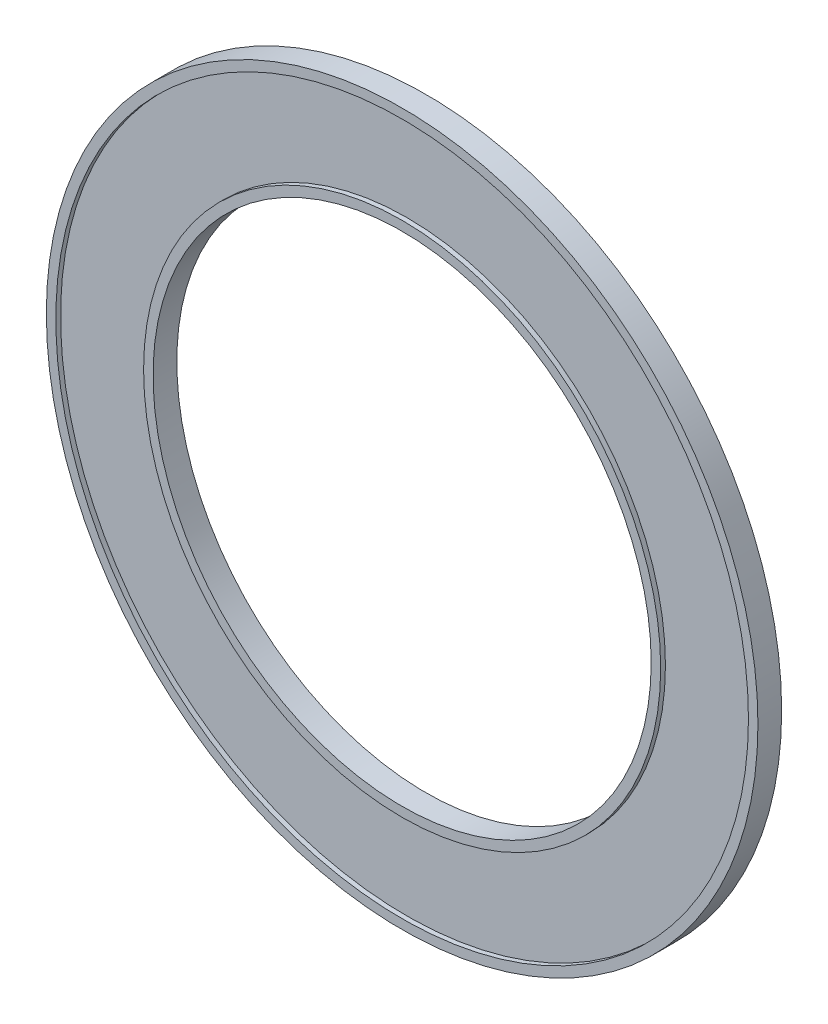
ISO-10303-21;
HEADER;
FILE_DESCRIPTION(('STEP AP214'),'2;1');
FILE_NAME('part.step','',(''),(''),'','','');
FILE_SCHEMA(('AUTOMOTIVE_DESIGN { 1 0 10303 214 1 1 1 1 }'));
ENDSEC;
DATA;
#1=APPLICATION_CONTEXT('core data for automotive mechanical design processes');
#2=APPLICATION_PROTOCOL_DEFINITION('international standard','automotive_design',2000,#1);
#3=PRODUCT_CONTEXT('',#1,'mechanical');
#4=PRODUCT('Part','Part','',(#3));
#5=PRODUCT_RELATED_PRODUCT_CATEGORY('part','',(#4));
#6=PRODUCT_DEFINITION_FORMATION('','',#4);
#7=PRODUCT_DEFINITION_CONTEXT('part definition',#1,'design');
#8=PRODUCT_DEFINITION('design','',#6,#7);
#9=PRODUCT_DEFINITION_SHAPE('','',#8);
#10=(LENGTH_UNIT() NAMED_UNIT(*) SI_UNIT(.MILLI.,.METRE.));
#11=(NAMED_UNIT(*) PLANE_ANGLE_UNIT() SI_UNIT($,.RADIAN.));
#12=(NAMED_UNIT(*) SI_UNIT($,.STERADIAN.) SOLID_ANGLE_UNIT());
#13=UNCERTAINTY_MEASURE_WITH_UNIT(LENGTH_MEASURE(1.E-05),#10,'distance_accuracy_value','');
#14=(GEOMETRIC_REPRESENTATION_CONTEXT(3) GLOBAL_UNCERTAINTY_ASSIGNED_CONTEXT((#13)) GLOBAL_UNIT_ASSIGNED_CONTEXT((#10,
#11,#12)) REPRESENTATION_CONTEXT('',''));
#15=CARTESIAN_POINT('',(0.,0.,0.));
#16=DIRECTION('',(0.,0.,1.));
#17=DIRECTION('',(1.,0.,0.));
#18=AXIS2_PLACEMENT_3D('',#15,#16,#17);
#19=CARTESIAN_POINT('',(0.,0.,10.));
#20=DIRECTION('',(0.,0.,1.));
#21=DIRECTION('',(1.,0.,0.));
#22=AXIS2_PLACEMENT_3D('',#19,#20,#21);
#23=PLANE('',#22);
#24=CARTESIAN_POINT('',(0.,0.,10.));
#25=DIRECTION('',(0.,0.,1.));
#26=DIRECTION('',(1.,0.,0.));
#27=AXIS2_PLACEMENT_3D('',#24,#25,#26);
#28=CIRCLE('',#27,105.);
#29=CARTESIAN_POINT('',(105.,0.,10.));
#30=VERTEX_POINT('',#29);
#31=EDGE_CURVE('E42',#30,#30,#28,.T.);
#32=ORIENTED_EDGE('',*,*,#31,.F.);
#33=EDGE_LOOP('',(#32));
#34=FACE_BOUND('',#33,.T.);
#35=CARTESIAN_POINT('',(0.,0.,10.));
#36=DIRECTION('',(0.,0.,1.));
#37=DIRECTION('',(1.,0.,0.));
#38=AXIS2_PLACEMENT_3D('',#35,#36,#37);
#39=CIRCLE('',#38,109.);
#40=CARTESIAN_POINT('',(109.,0.,10.));
#41=VERTEX_POINT('',#40);
#42=EDGE_CURVE('E54',#41,#41,#39,.T.);
#43=ORIENTED_EDGE('',*,*,#42,.T.);
#44=EDGE_LOOP('',(#43));
#45=FACE_BOUND('',#44,.T.);
#46=ADVANCED_FACE('F31',(#34,#45),#23,.T.);
#47=CARTESIAN_POINT('',(0.,0.,10.));
#48=DIRECTION('',(0.,0.,1.));
#49=DIRECTION('',(1.,0.,0.));
#50=AXIS2_PLACEMENT_3D('',#47,#48,#49);
#51=CIRCLE('',#50,146.);
#52=CARTESIAN_POINT('',(146.,0.,10.));
#53=VERTEX_POINT('',#52);
#54=EDGE_CURVE('E50',#53,#53,#51,.T.);
#55=ORIENTED_EDGE('',*,*,#54,.F.);
#56=EDGE_LOOP('',(#55));
#57=FACE_BOUND('',#56,.T.);
#58=CARTESIAN_POINT('',(0.,0.,10.));
#59=DIRECTION('',(0.,0.,1.));
#60=DIRECTION('',(1.,0.,0.));
#61=AXIS2_PLACEMENT_3D('',#58,#59,#60);
#62=CIRCLE('',#61,150.);
#63=CARTESIAN_POINT('',(150.,0.,10.));
#64=VERTEX_POINT('',#63);
#65=EDGE_CURVE('E10',#64,#64,#62,.T.);
#66=ORIENTED_EDGE('',*,*,#65,.T.);
#67=EDGE_LOOP('',(#66));
#68=FACE_BOUND('',#67,.T.);
#69=ADVANCED_FACE('F86',(#57,#68),#23,.T.);
#70=CARTESIAN_POINT('',(0.,0.,0.));
#71=DIRECTION('',(0.,0.,1.));
#72=DIRECTION('',(1.,0.,0.));
#73=AXIS2_PLACEMENT_3D('',#70,#71,#72);
#74=PLANE('',#73);
#75=CARTESIAN_POINT('',(0.,126.,0.));
#76=DIRECTION('',(0.,0.,-1.));
#77=DIRECTION('',(-1.,0.,0.));
#78=AXIS2_PLACEMENT_3D('',#75,#76,#77);
#79=CIRCLE('',#78,5.);
#80=CARTESIAN_POINT('',(-5.,126.,0.));
#81=VERTEX_POINT('',#80);
#82=EDGE_CURVE('E68',#81,#81,#79,.T.);
#83=ORIENTED_EDGE('',*,*,#82,.F.);
#84=EDGE_LOOP('',(#83));
#85=FACE_BOUND('',#84,.T.);
#86=CARTESIAN_POINT('',(0.,-126.,0.));
#87=DIRECTION('',(0.,0.,-1.));
#88=DIRECTION('',(-1.,0.,0.));
#89=AXIS2_PLACEMENT_3D('',#86,#87,#88);
#90=CIRCLE('',#89,5.);
#91=CARTESIAN_POINT('',(-5.,-126.,0.));
#92=VERTEX_POINT('',#91);
#93=EDGE_CURVE('E62',#92,#92,#90,.T.);
#94=ORIENTED_EDGE('',*,*,#93,.F.);
#95=EDGE_LOOP('',(#94));
#96=FACE_BOUND('',#95,.T.);
#97=CARTESIAN_POINT('',(0.,0.,0.));
#98=DIRECTION('',(0.,0.,1.));
#99=DIRECTION('',(1.,0.,0.));
#100=AXIS2_PLACEMENT_3D('',#97,#98,#99);
#101=CIRCLE('',#100,150.);
#102=CARTESIAN_POINT('',(150.,0.,0.));
#103=VERTEX_POINT('',#102);
#104=EDGE_CURVE('E35',#103,#103,#101,.T.);
#105=ORIENTED_EDGE('',*,*,#104,.F.);
#106=EDGE_LOOP('',(#105));
#107=FACE_BOUND('',#106,.T.);
#108=CARTESIAN_POINT('',(0.,0.,0.));
#109=DIRECTION('',(0.,0.,1.));
#110=DIRECTION('',(1.,0.,0.));
#111=AXIS2_PLACEMENT_3D('',#108,#109,#110);
#112=CIRCLE('',#111,105.);
#113=CARTESIAN_POINT('',(105.,0.,0.));
#114=VERTEX_POINT('',#113);
#115=EDGE_CURVE('E44',#114,#114,#112,.T.);
#116=ORIENTED_EDGE('',*,*,#115,.T.);
#117=EDGE_LOOP('',(#116));
#118=FACE_BOUND('',#117,.T.);
#119=ADVANCED_FACE('F83',(#85,#96,#107,#118),#74,.F.);
#120=CARTESIAN_POINT('',(0.,0.,10.));
#121=DIRECTION('',(0.,0.,-1.));
#122=DIRECTION('',(-1.,0.,0.));
#123=AXIS2_PLACEMENT_3D('',#120,#121,#122);
#124=CYLINDRICAL_SURFACE('',#123,150.);
#125=ORIENTED_EDGE('',*,*,#65,.F.);
#126=EDGE_LOOP('',(#125));
#127=FACE_BOUND('',#126,.T.);
#128=ORIENTED_EDGE('',*,*,#104,.T.);
#129=EDGE_LOOP('',(#128));
#130=FACE_BOUND('',#129,.T.);
#131=ADVANCED_FACE('F33',(#127,#130),#124,.T.);
#132=CARTESIAN_POINT('',(0.,0.,10.));
#133=DIRECTION('',(0.,0.,-1.));
#134=DIRECTION('',(-1.,0.,0.));
#135=AXIS2_PLACEMENT_3D('',#132,#133,#134);
#136=CYLINDRICAL_SURFACE('',#135,105.);
#137=ORIENTED_EDGE('',*,*,#31,.T.);
#138=EDGE_LOOP('',(#137));
#139=FACE_BOUND('',#138,.T.);
#140=ORIENTED_EDGE('',*,*,#115,.F.);
#141=EDGE_LOOP('',(#140));
#142=FACE_BOUND('',#141,.T.);
#143=ADVANCED_FACE('F93',(#139,#142),#136,.F.);
#144=CARTESIAN_POINT('',(0.,0.,8.));
#145=DIRECTION('',(0.,0.,1.));
#146=DIRECTION('',(1.,0.,0.));
#147=AXIS2_PLACEMENT_3D('',#144,#145,#146);
#148=CYLINDRICAL_SURFACE('',#147,109.);
#149=CARTESIAN_POINT('',(0.,0.,8.));
#150=DIRECTION('',(0.,0.,1.));
#151=DIRECTION('',(1.,0.,0.));
#152=AXIS2_PLACEMENT_3D('',#149,#150,#151);
#153=CIRCLE('',#152,109.);
#154=CARTESIAN_POINT('',(109.,0.,8.));
#155=VERTEX_POINT('',#154);
#156=EDGE_CURVE('E53',#155,#155,#153,.T.);
#157=ORIENTED_EDGE('',*,*,#156,.T.);
#158=EDGE_LOOP('',(#157));
#159=FACE_BOUND('',#158,.T.);
#160=ORIENTED_EDGE('',*,*,#42,.F.);
#161=EDGE_LOOP('',(#160));
#162=FACE_BOUND('',#161,.T.);
#163=ADVANCED_FACE('F95',(#159,#162),#148,.T.);
#164=CARTESIAN_POINT('',(0.,0.,8.));
#165=DIRECTION('',(0.,0.,1.));
#166=DIRECTION('',(1.,0.,0.));
#167=AXIS2_PLACEMENT_3D('',#164,#165,#166);
#168=CYLINDRICAL_SURFACE('',#167,146.);
#169=CARTESIAN_POINT('',(0.,0.,8.));
#170=DIRECTION('',(0.,0.,1.));
#171=DIRECTION('',(1.,0.,0.));
#172=AXIS2_PLACEMENT_3D('',#169,#170,#171);
#173=CIRCLE('',#172,146.);
#174=CARTESIAN_POINT('',(146.,0.,8.));
#175=VERTEX_POINT('',#174);
#176=EDGE_CURVE('E47',#175,#175,#173,.T.);
#177=ORIENTED_EDGE('',*,*,#176,.F.);
#178=EDGE_LOOP('',(#177));
#179=FACE_BOUND('',#178,.T.);
#180=ORIENTED_EDGE('',*,*,#54,.T.);
#181=EDGE_LOOP('',(#180));
#182=FACE_BOUND('',#181,.T.);
#183=ADVANCED_FACE('F102',(#179,#182),#168,.F.);
#184=CARTESIAN_POINT('',(0.,0.,8.));
#185=DIRECTION('',(0.,0.,1.));
#186=DIRECTION('',(1.,0.,0.));
#187=AXIS2_PLACEMENT_3D('',#184,#185,#186);
#188=PLANE('',#187);
#189=ORIENTED_EDGE('',*,*,#156,.F.);
#190=EDGE_LOOP('',(#189));
#191=FACE_BOUND('',#190,.T.);
#192=ORIENTED_EDGE('',*,*,#176,.T.);
#193=EDGE_LOOP('',(#192));
#194=FACE_BOUND('',#193,.T.);
#195=ADVANCED_FACE('F122',(#191,#194),#188,.T.);
#196=CARTESIAN_POINT('',(0.,-126.,6.));
#197=DIRECTION('',(0.,0.,-1.));
#198=DIRECTION('',(-1.,0.,0.));
#199=AXIS2_PLACEMENT_3D('',#196,#197,#198);
#200=CYLINDRICAL_SURFACE('',#199,5.);
#201=CARTESIAN_POINT('',(0.,-126.,6.));
#202=DIRECTION('',(0.,0.,-1.));
#203=DIRECTION('',(-1.,0.,0.));
#204=AXIS2_PLACEMENT_3D('',#201,#202,#203);
#205=CIRCLE('',#204,5.);
#206=CARTESIAN_POINT('',(-5.,-126.,6.));
#207=VERTEX_POINT('',#206);
#208=EDGE_CURVE('E65',#207,#207,#205,.T.);
#209=ORIENTED_EDGE('',*,*,#208,.F.);
#210=EDGE_LOOP('',(#209));
#211=FACE_BOUND('',#210,.T.);
#212=ORIENTED_EDGE('',*,*,#93,.T.);
#213=EDGE_LOOP('',(#212));
#214=FACE_BOUND('',#213,.T.);
#215=ADVANCED_FACE('F128',(#211,#214),#200,.F.);
#216=CARTESIAN_POINT('',(0.,-126.,6.));
#217=DIRECTION('',(0.,0.,-1.));
#218=DIRECTION('',(-1.,0.,0.));
#219=AXIS2_PLACEMENT_3D('',#216,#217,#218);
#220=PLANE('',#219);
#221=ORIENTED_EDGE('',*,*,#208,.T.);
#222=EDGE_LOOP('',(#221));
#223=FACE_BOUND('',#222,.T.);
#224=ADVANCED_FACE('F79',(#223),#220,.T.);
#225=CARTESIAN_POINT('',(0.,126.,6.));
#226=DIRECTION('',(0.,0.,-1.));
#227=DIRECTION('',(-1.,0.,0.));
#228=AXIS2_PLACEMENT_3D('',#225,#226,#227);
#229=CYLINDRICAL_SURFACE('',#228,5.);
#230=CARTESIAN_POINT('',(0.,126.,6.));
#231=DIRECTION('',(0.,0.,-1.));
#232=DIRECTION('',(-1.,0.,0.));
#233=AXIS2_PLACEMENT_3D('',#230,#231,#232);
#234=CIRCLE('',#233,5.);
#235=CARTESIAN_POINT('',(-5.,126.,6.));
#236=VERTEX_POINT('',#235);
#237=EDGE_CURVE('E57',#236,#236,#234,.T.);
#238=ORIENTED_EDGE('',*,*,#237,.F.);
#239=EDGE_LOOP('',(#238));
#240=FACE_BOUND('',#239,.T.);
#241=ORIENTED_EDGE('',*,*,#82,.T.);
#242=EDGE_LOOP('',(#241));
#243=FACE_BOUND('',#242,.T.);
#244=ADVANCED_FACE('F76',(#240,#243),#229,.F.);
#245=CARTESIAN_POINT('',(0.,126.,6.));
#246=DIRECTION('',(0.,0.,-1.));
#247=DIRECTION('',(-1.,0.,0.));
#248=AXIS2_PLACEMENT_3D('',#245,#246,#247);
#249=PLANE('',#248);
#250=ORIENTED_EDGE('',*,*,#237,.T.);
#251=EDGE_LOOP('',(#250));
#252=FACE_BOUND('',#251,.T.);
#253=ADVANCED_FACE('F74',(#252),#249,.T.);
#254=CLOSED_SHELL('',(#46,#69,#119,#131,#143,#163,#183,#195,#215,#224,#244,#253));
#255=MANIFOLD_SOLID_BREP('B2',#254);
#256=ADVANCED_BREP_SHAPE_REPRESENTATION('',(#18,#255),#14);
#257=SHAPE_DEFINITION_REPRESENTATION(#9,#256);
ENDSEC;
END-ISO-10303-21;
